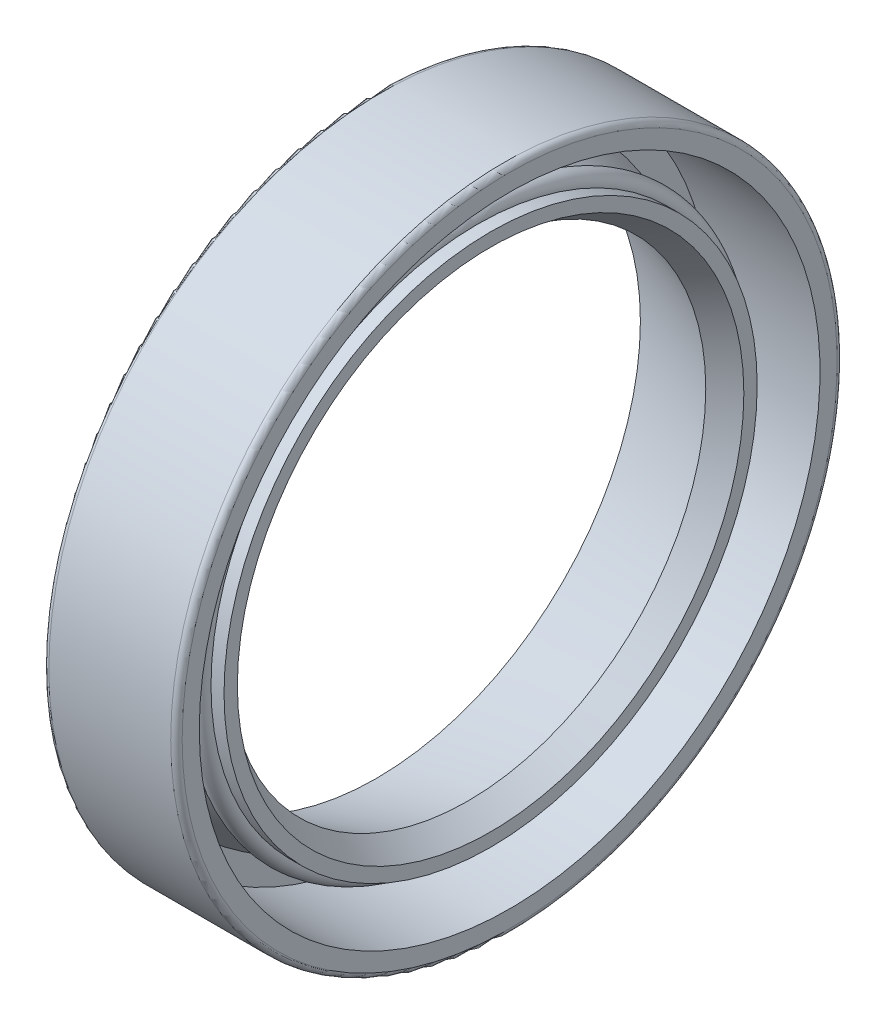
ISO-10303-21;
HEADER;
FILE_DESCRIPTION(('STEP AP214'),'2;1');
FILE_NAME('part.step','',(''),(''),'','','');
FILE_SCHEMA(('AUTOMOTIVE_DESIGN { 1 0 10303 214 1 1 1 1 }'));
ENDSEC;
DATA;
#1=APPLICATION_CONTEXT('core data for automotive mechanical design processes');
#2=APPLICATION_PROTOCOL_DEFINITION('international standard','automotive_design',2000,#1);
#3=PRODUCT_CONTEXT('',#1,'mechanical');
#4=PRODUCT('Part','Part','',(#3));
#5=PRODUCT_RELATED_PRODUCT_CATEGORY('part','',(#4));
#6=PRODUCT_DEFINITION_FORMATION('','',#4);
#7=PRODUCT_DEFINITION_CONTEXT('part definition',#1,'design');
#8=PRODUCT_DEFINITION('design','',#6,#7);
#9=PRODUCT_DEFINITION_SHAPE('','',#8);
#10=(LENGTH_UNIT() NAMED_UNIT(*) SI_UNIT(.MILLI.,.METRE.));
#11=(NAMED_UNIT(*) PLANE_ANGLE_UNIT() SI_UNIT($,.RADIAN.));
#12=(NAMED_UNIT(*) SI_UNIT($,.STERADIAN.) SOLID_ANGLE_UNIT());
#13=UNCERTAINTY_MEASURE_WITH_UNIT(LENGTH_MEASURE(1.E-05),#10,'distance_accuracy_value','');
#14=(GEOMETRIC_REPRESENTATION_CONTEXT(3) GLOBAL_UNCERTAINTY_ASSIGNED_CONTEXT((#13)) GLOBAL_UNIT_ASSIGNED_CONTEXT((#10,
#11,#12)) REPRESENTATION_CONTEXT('',''));
#15=CARTESIAN_POINT('',(0.,0.,0.));
#16=DIRECTION('',(0.,0.,1.));
#17=DIRECTION('',(1.,0.,0.));
#18=AXIS2_PLACEMENT_3D('',#15,#16,#17);
#19=CARTESIAN_POINT('',(1.20000000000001,0.,-16.3));
#20=DIRECTION('',(-1.,0.,0.));
#21=DIRECTION('',(0.,0.,1.));
#22=AXIS2_PLACEMENT_3D('',#19,#20,#21);
#23=PLANE('',#22);
#24=CARTESIAN_POINT('',(1.20000000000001,0.,0.));
#25=DIRECTION('',(-1.,0.,0.));
#26=DIRECTION('',(0.,0.,1.));
#27=AXIS2_PLACEMENT_3D('',#24,#25,#26);
#28=CIRCLE('',#27,16.3);
#29=CARTESIAN_POINT('',(1.20000000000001,0.,16.3));
#30=VERTEX_POINT('',#29);
#31=EDGE_CURVE('E10',#30,#30,#28,.T.);
#32=ORIENTED_EDGE('',*,*,#31,.F.);
#33=EDGE_LOOP('',(#32));
#34=FACE_BOUND('',#33,.T.);
#35=CARTESIAN_POINT('',(1.20000000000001,0.,0.));
#36=DIRECTION('',(-1.,0.,0.));
#37=DIRECTION('',(0.,0.,1.));
#38=AXIS2_PLACEMENT_3D('',#35,#36,#37);
#39=CIRCLE('',#38,14.9450381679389);
#40=CARTESIAN_POINT('',(1.20000000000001,0.,14.9450381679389));
#41=VERTEX_POINT('',#40);
#42=EDGE_CURVE('E70',#41,#41,#39,.T.);
#43=ORIENTED_EDGE('',*,*,#42,.T.);
#44=EDGE_LOOP('',(#43));
#45=FACE_BOUND('',#44,.T.);
#46=ADVANCED_FACE('F27',(#34,#45),#23,.F.);
#47=CARTESIAN_POINT('',(0.,0.,0.));
#48=DIRECTION('',(-1.,0.,0.));
#49=DIRECTION('',(0.,0.,1.));
#50=AXIS2_PLACEMENT_3D('',#47,#48,#49);
#51=CYLINDRICAL_SURFACE('',#50,16.3);
#52=CARTESIAN_POINT('',(7.00000000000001,0.,0.));
#53=DIRECTION('',(-1.,0.,0.));
#54=DIRECTION('',(0.,0.,1.));
#55=AXIS2_PLACEMENT_3D('',#52,#53,#54);
#56=CIRCLE('',#55,16.3);
#57=CARTESIAN_POINT('',(7.00000000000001,0.,16.3));
#58=VERTEX_POINT('',#57);
#59=EDGE_CURVE('E33',#58,#58,#56,.T.);
#60=ORIENTED_EDGE('',*,*,#59,.F.);
#61=EDGE_LOOP('',(#60));
#62=FACE_BOUND('',#61,.T.);
#63=ORIENTED_EDGE('',*,*,#31,.T.);
#64=EDGE_LOOP('',(#63));
#65=FACE_BOUND('',#64,.T.);
#66=ADVANCED_FACE('F137',(#62,#65),#51,.F.);
#67=CARTESIAN_POINT('',(7.00000000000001,0.,-16.3));
#68=DIRECTION('',(-1.,0.,0.));
#69=DIRECTION('',(0.,0.,1.));
#70=AXIS2_PLACEMENT_3D('',#67,#68,#69);
#71=PLANE('',#70);
#72=CARTESIAN_POINT('',(7.00000000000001,0.,0.));
#73=DIRECTION('',(-1.,0.,0.));
#74=DIRECTION('',(0.,0.,1.));
#75=AXIS2_PLACEMENT_3D('',#72,#73,#74);
#76=CIRCLE('',#75,17.2);
#77=CARTESIAN_POINT('',(7.00000000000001,0.,17.2));
#78=VERTEX_POINT('',#77);
#79=EDGE_CURVE('E37',#78,#78,#76,.T.);
#80=ORIENTED_EDGE('',*,*,#79,.F.);
#81=EDGE_LOOP('',(#80));
#82=FACE_BOUND('',#81,.T.);
#83=ORIENTED_EDGE('',*,*,#59,.T.);
#84=EDGE_LOOP('',(#83));
#85=FACE_BOUND('',#84,.T.);
#86=ADVANCED_FACE('F132',(#82,#85),#71,.F.);
#87=CARTESIAN_POINT('',(6.7,0.,0.));
#88=DIRECTION('',(-1.,0.,0.));
#89=DIRECTION('',(0.,0.,1.));
#90=AXIS2_PLACEMENT_3D('',#87,#88,#89);
#91=TOROIDAL_SURFACE('',#90,17.2,0.300000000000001);
#92=CARTESIAN_POINT('',(6.7,0.,0.));
#93=DIRECTION('',(-1.,0.,0.));
#94=DIRECTION('',(0.,0.,1.));
#95=AXIS2_PLACEMENT_3D('',#92,#93,#94);
#96=CIRCLE('',#95,17.5);
#97=CARTESIAN_POINT('',(6.7,0.,17.5));
#98=VERTEX_POINT('',#97);
#99=EDGE_CURVE('E41',#98,#98,#96,.T.);
#100=ORIENTED_EDGE('',*,*,#99,.F.);
#101=EDGE_LOOP('',(#100));
#102=FACE_BOUND('',#101,.T.);
#103=ORIENTED_EDGE('',*,*,#79,.T.);
#104=EDGE_LOOP('',(#103));
#105=FACE_BOUND('',#104,.T.);
#106=ADVANCED_FACE('F126',(#102,#105),#91,.T.);
#107=CARTESIAN_POINT('',(0.,0.,0.));
#108=DIRECTION('',(-1.,0.,0.));
#109=DIRECTION('',(0.,0.,1.));
#110=AXIS2_PLACEMENT_3D('',#107,#108,#109);
#111=CYLINDRICAL_SURFACE('',#110,17.5);
#112=CARTESIAN_POINT('',(0.299999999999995,0.,0.));
#113=DIRECTION('',(-1.,0.,0.));
#114=DIRECTION('',(0.,0.,1.));
#115=AXIS2_PLACEMENT_3D('',#112,#113,#114);
#116=CIRCLE('',#115,17.5);
#117=CARTESIAN_POINT('',(0.299999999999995,0.,17.5));
#118=VERTEX_POINT('',#117);
#119=EDGE_CURVE('E46',#118,#118,#116,.T.);
#120=ORIENTED_EDGE('',*,*,#119,.F.);
#121=EDGE_LOOP('',(#120));
#122=FACE_BOUND('',#121,.T.);
#123=ORIENTED_EDGE('',*,*,#99,.T.);
#124=EDGE_LOOP('',(#123));
#125=FACE_BOUND('',#124,.T.);
#126=ADVANCED_FACE('F120',(#122,#125),#111,.T.);
#127=CARTESIAN_POINT('',(0.299999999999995,0.,0.));
#128=DIRECTION('',(-1.,0.,0.));
#129=DIRECTION('',(0.,0.,1.));
#130=AXIS2_PLACEMENT_3D('',#127,#128,#129);
#131=TOROIDAL_SURFACE('',#130,17.2,0.299999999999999);
#132=CARTESIAN_POINT('',(0.,0.,0.));
#133=DIRECTION('',(-1.,0.,0.));
#134=DIRECTION('',(0.,0.,1.));
#135=AXIS2_PLACEMENT_3D('',#132,#133,#134);
#136=CIRCLE('',#135,17.2);
#137=CARTESIAN_POINT('',(0.,0.,17.2));
#138=VERTEX_POINT('',#137);
#139=EDGE_CURVE('E49',#138,#138,#136,.T.);
#140=ORIENTED_EDGE('',*,*,#139,.F.);
#141=EDGE_LOOP('',(#140));
#142=FACE_BOUND('',#141,.T.);
#143=ORIENTED_EDGE('',*,*,#119,.T.);
#144=EDGE_LOOP('',(#143));
#145=FACE_BOUND('',#144,.T.);
#146=ADVANCED_FACE('F114',(#142,#145),#131,.T.);
#147=CARTESIAN_POINT('',(0.,0.,-13.8666666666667));
#148=DIRECTION('',(1.,0.,0.));
#149=DIRECTION('',(0.,0.,-1.));
#150=AXIS2_PLACEMENT_3D('',#147,#148,#149);
#151=PLANE('',#150);
#152=CARTESIAN_POINT('',(0.,0.,0.));
#153=DIRECTION('',(-1.,0.,0.));
#154=DIRECTION('',(0.,0.,1.));
#155=AXIS2_PLACEMENT_3D('',#152,#153,#154);
#156=CIRCLE('',#155,13.8666666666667);
#157=CARTESIAN_POINT('',(0.,0.,13.8666666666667));
#158=VERTEX_POINT('',#157);
#159=EDGE_CURVE('E52',#158,#158,#156,.T.);
#160=ORIENTED_EDGE('',*,*,#159,.F.);
#161=EDGE_LOOP('',(#160));
#162=FACE_BOUND('',#161,.T.);
#163=ORIENTED_EDGE('',*,*,#139,.T.);
#164=EDGE_LOOP('',(#163));
#165=FACE_BOUND('',#164,.T.);
#166=ADVANCED_FACE('F108',(#162,#165),#151,.F.);
#167=CARTESIAN_POINT('',(0.,0.,0.));
#168=DIRECTION('',(-1.,0.,0.));
#169=DIRECTION('',(0.,0.,1.));
#170=AXIS2_PLACEMENT_3D('',#167,#168,#169);
#171=CONICAL_SURFACE('',#170,13.8666666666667,0.277382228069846);
#172=CARTESIAN_POINT('',(4.8,0.,0.));
#173=DIRECTION('',(-1.,0.,0.));
#174=DIRECTION('',(0.,0.,1.));
#175=AXIS2_PLACEMENT_3D('',#172,#173,#174);
#176=CIRCLE('',#175,12.5);
#177=CARTESIAN_POINT('',(4.8,0.,12.5));
#178=VERTEX_POINT('',#177);
#179=EDGE_CURVE('E55',#178,#178,#176,.T.);
#180=ORIENTED_EDGE('',*,*,#179,.F.);
#181=EDGE_LOOP('',(#180));
#182=FACE_BOUND('',#181,.T.);
#183=ORIENTED_EDGE('',*,*,#159,.T.);
#184=EDGE_LOOP('',(#183));
#185=FACE_BOUND('',#184,.T.);
#186=ADVANCED_FACE('F102',(#182,#185),#171,.F.);
#187=CARTESIAN_POINT('',(4.8,0.,0.));
#188=DIRECTION('',(1.,0.,0.));
#189=DIRECTION('',(0.,0.,-1.));
#190=AXIS2_PLACEMENT_3D('',#187,#188,#189);
#191=CONICAL_SURFACE('',#190,12.5,0.588002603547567);
#192=CARTESIAN_POINT('',(6.00000000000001,0.,0.));
#193=DIRECTION('',(-1.,0.,0.));
#194=DIRECTION('',(0.,0.,1.));
#195=AXIS2_PLACEMENT_3D('',#192,#193,#194);
#196=CIRCLE('',#195,13.3);
#197=CARTESIAN_POINT('',(6.00000000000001,0.,13.3));
#198=VERTEX_POINT('',#197);
#199=EDGE_CURVE('E58',#198,#198,#196,.T.);
#200=ORIENTED_EDGE('',*,*,#199,.F.);
#201=EDGE_LOOP('',(#200));
#202=FACE_BOUND('',#201,.T.);
#203=ORIENTED_EDGE('',*,*,#179,.T.);
#204=EDGE_LOOP('',(#203));
#205=FACE_BOUND('',#204,.T.);
#206=ADVANCED_FACE('F96',(#202,#205),#191,.F.);
#207=CARTESIAN_POINT('',(6.00000000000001,0.,-13.3));
#208=DIRECTION('',(-1.,0.,0.));
#209=DIRECTION('',(0.,0.,1.));
#210=AXIS2_PLACEMENT_3D('',#207,#208,#209);
#211=PLANE('',#210);
#212=CARTESIAN_POINT('',(6.00000000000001,0.,0.));
#213=DIRECTION('',(-1.,0.,0.));
#214=DIRECTION('',(0.,0.,1.));
#215=AXIS2_PLACEMENT_3D('',#212,#213,#214);
#216=CIRCLE('',#215,14.0000000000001);
#217=CARTESIAN_POINT('',(6.00000000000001,0.,14.0000000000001));
#218=VERTEX_POINT('',#217);
#219=EDGE_CURVE('E61',#218,#218,#216,.T.);
#220=ORIENTED_EDGE('',*,*,#219,.F.);
#221=EDGE_LOOP('',(#220));
#222=FACE_BOUND('',#221,.T.);
#223=ORIENTED_EDGE('',*,*,#199,.T.);
#224=EDGE_LOOP('',(#223));
#225=FACE_BOUND('',#224,.T.);
#226=ADVANCED_FACE('F90',(#222,#225),#211,.F.);
#227=CARTESIAN_POINT('',(0.,0.,0.));
#228=DIRECTION('',(-1.,0.,0.));
#229=DIRECTION('',(0.,0.,1.));
#230=AXIS2_PLACEMENT_3D('',#227,#228,#229);
#231=CYLINDRICAL_SURFACE('',#230,14.0000000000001);
#232=CARTESIAN_POINT('',(5.31538820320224,0.,0.));
#233=DIRECTION('',(-1.,0.,0.));
#234=DIRECTION('',(0.,0.,1.));
#235=AXIS2_PLACEMENT_3D('',#232,#233,#234);
#236=CIRCLE('',#235,14.0000000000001);
#237=CARTESIAN_POINT('',(5.31538820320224,0.,14.0000000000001));
#238=VERTEX_POINT('',#237);
#239=EDGE_CURVE('E64',#238,#238,#236,.T.);
#240=ORIENTED_EDGE('',*,*,#239,.F.);
#241=EDGE_LOOP('',(#240));
#242=FACE_BOUND('',#241,.T.);
#243=ORIENTED_EDGE('',*,*,#219,.T.);
#244=EDGE_LOOP('',(#243));
#245=FACE_BOUND('',#244,.T.);
#246=ADVANCED_FACE('F84',(#242,#245),#231,.T.);
#247=CARTESIAN_POINT('',(4.8,0.,0.));
#248=DIRECTION('',(-1.,0.,0.));
#249=DIRECTION('',(0.,0.,1.));
#250=AXIS2_PLACEMENT_3D('',#247,#248,#249);
#251=TOROIDAL_SURFACE('',#250,14.1,0.525);
#252=CARTESIAN_POINT('',(4.275,0.,0.));
#253=DIRECTION('',(-1.,0.,0.));
#254=DIRECTION('',(0.,0.,1.));
#255=AXIS2_PLACEMENT_3D('',#252,#253,#254);
#256=CIRCLE('',#255,14.1);
#257=CARTESIAN_POINT('',(4.275,0.,14.1));
#258=VERTEX_POINT('',#257);
#259=EDGE_CURVE('E67',#258,#258,#256,.T.);
#260=ORIENTED_EDGE('',*,*,#259,.F.);
#261=EDGE_LOOP('',(#260));
#262=FACE_BOUND('',#261,.T.);
#263=ORIENTED_EDGE('',*,*,#239,.T.);
#264=EDGE_LOOP('',(#263));
#265=FACE_BOUND('',#264,.T.);
#266=ADVANCED_FACE('F78',(#262,#265),#251,.T.);
#267=CARTESIAN_POINT('',(4.275,0.,0.));
#268=DIRECTION('',(-1.,0.,0.));
#269=DIRECTION('',(0.,0.,1.));
#270=AXIS2_PLACEMENT_3D('',#267,#268,#269);
#271=CONICAL_SURFACE('',#270,14.1,0.26818878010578);
#272=ORIENTED_EDGE('',*,*,#42,.F.);
#273=EDGE_LOOP('',(#272));
#274=FACE_BOUND('',#273,.T.);
#275=ORIENTED_EDGE('',*,*,#259,.T.);
#276=EDGE_LOOP('',(#275));
#277=FACE_BOUND('',#276,.T.);
#278=ADVANCED_FACE('F75',(#274,#277),#271,.T.);
#279=CLOSED_SHELL('',(#46,#66,#86,#106,#126,#146,#166,#186,#206,#226,#246,#266,#278));
#280=MANIFOLD_SOLID_BREP('B2',#279);
#281=ADVANCED_BREP_SHAPE_REPRESENTATION('',(#18,#280),#14);
#282=SHAPE_DEFINITION_REPRESENTATION(#9,#281);
ENDSEC;
END-ISO-10303-21;
